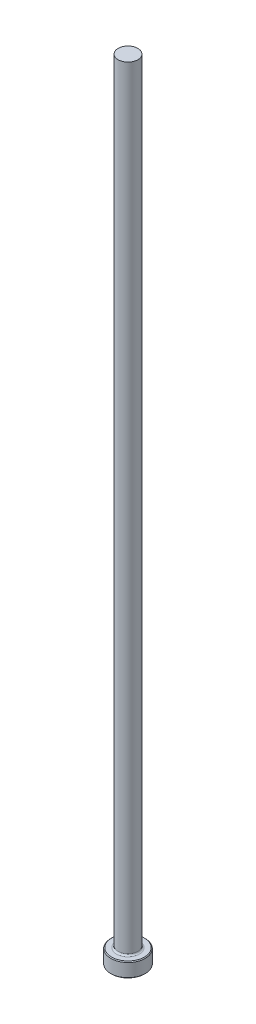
ISO-10303-21;
HEADER;
FILE_DESCRIPTION(('STEP AP214'),'2;1');
FILE_NAME('part.step','',(''),(''),'','','');
FILE_SCHEMA(('AUTOMOTIVE_DESIGN { 1 0 10303 214 1 1 1 1 }'));
ENDSEC;
DATA;
#1=APPLICATION_CONTEXT('core data for automotive mechanical design processes');
#2=APPLICATION_PROTOCOL_DEFINITION('international standard','automotive_design',2000,#1);
#3=PRODUCT_CONTEXT('',#1,'mechanical');
#4=PRODUCT('Part','Part','',(#3));
#5=PRODUCT_RELATED_PRODUCT_CATEGORY('part','',(#4));
#6=PRODUCT_DEFINITION_FORMATION('','',#4);
#7=PRODUCT_DEFINITION_CONTEXT('part definition',#1,'design');
#8=PRODUCT_DEFINITION('design','',#6,#7);
#9=PRODUCT_DEFINITION_SHAPE('','',#8);
#10=(LENGTH_UNIT() NAMED_UNIT(*) SI_UNIT(.MILLI.,.METRE.));
#11=(NAMED_UNIT(*) PLANE_ANGLE_UNIT() SI_UNIT($,.RADIAN.));
#12=(NAMED_UNIT(*) SI_UNIT($,.STERADIAN.) SOLID_ANGLE_UNIT());
#13=UNCERTAINTY_MEASURE_WITH_UNIT(LENGTH_MEASURE(1.E-05),#10,'distance_accuracy_value','');
#14=(GEOMETRIC_REPRESENTATION_CONTEXT(3) GLOBAL_UNCERTAINTY_ASSIGNED_CONTEXT((#13)) GLOBAL_UNIT_ASSIGNED_CONTEXT((#10,
#11,#12)) REPRESENTATION_CONTEXT('',''));
#15=CARTESIAN_POINT('',(0.,0.,0.));
#16=DIRECTION('',(0.,0.,1.));
#17=DIRECTION('',(1.,0.,0.));
#18=AXIS2_PLACEMENT_3D('',#15,#16,#17);
#19=CARTESIAN_POINT('',(0.,0.,0.));
#20=DIRECTION('',(0.,-1.,0.));
#21=DIRECTION('',(0.,0.,-1.));
#22=AXIS2_PLACEMENT_3D('',#19,#20,#21);
#23=PLANE('',#22);
#24=CARTESIAN_POINT('',(0.,0.,0.));
#25=DIRECTION('',(0.,-1.,0.));
#26=DIRECTION('',(0.,0.,-1.));
#27=AXIS2_PLACEMENT_3D('',#24,#25,#26);
#28=CIRCLE('',#27,5.29589999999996);
#29=CARTESIAN_POINT('',(0.,0.,-5.29589999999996));
#30=VERTEX_POINT('',#29);
#31=EDGE_CURVE('E46',#30,#30,#28,.T.);
#32=ORIENTED_EDGE('',*,*,#31,.T.);
#33=EDGE_LOOP('',(#32));
#34=FACE_BOUND('',#33,.T.);
#35=ADVANCED_FACE('F35',(#34),#23,.T.);
#36=CARTESIAN_POINT('',(0.,259.958771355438,0.));
#37=DIRECTION('',(0.,1.,0.));
#38=DIRECTION('',(0.,0.,1.));
#39=AXIS2_PLACEMENT_3D('',#36,#37,#38);
#40=CYLINDRICAL_SURFACE('',#39,5.54989999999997);
#41=CARTESIAN_POINT('',(0.,4.49580000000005,0.));
#42=DIRECTION('',(0.,1.,0.));
#43=DIRECTION('',(0.,0.,1.));
#44=AXIS2_PLACEMENT_3D('',#41,#42,#43);
#45=CIRCLE('',#44,5.54989999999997);
#46=CARTESIAN_POINT('',(0.,4.49580000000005,5.54989999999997));
#47=VERTEX_POINT('',#46);
#48=EDGE_CURVE('E50',#47,#47,#45,.F.);
#49=ORIENTED_EDGE('',*,*,#48,.T.);
#50=EDGE_LOOP('',(#49));
#51=FACE_BOUND('',#50,.T.);
#52=CARTESIAN_POINT('',(0.,0.253999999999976,0.));
#53=DIRECTION('',(0.,-1.,0.));
#54=DIRECTION('',(0.,0.,-1.));
#55=AXIS2_PLACEMENT_3D('',#52,#53,#54);
#56=CIRCLE('',#55,5.54989999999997);
#57=CARTESIAN_POINT('',(0.,0.253999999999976,-5.54989999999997));
#58=VERTEX_POINT('',#57);
#59=EDGE_CURVE('E55',#58,#58,#56,.F.);
#60=ORIENTED_EDGE('',*,*,#59,.T.);
#61=EDGE_LOOP('',(#60));
#62=FACE_BOUND('',#61,.T.);
#63=ADVANCED_FACE('F77',(#51,#62),#40,.T.);
#64=CARTESIAN_POINT('',(-5.54989999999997,4.7498,0.));
#65=DIRECTION('',(0.,1.,0.));
#66=DIRECTION('',(0.,0.,1.));
#67=AXIS2_PLACEMENT_3D('',#64,#65,#66);
#68=PLANE('',#67);
#69=CARTESIAN_POINT('',(0.,4.7498,0.));
#70=DIRECTION('',(0.,1.,0.));
#71=DIRECTION('',(0.,0.,1.));
#72=AXIS2_PLACEMENT_3D('',#69,#70,#71);
#73=CIRCLE('',#72,3.68299999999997);
#74=CARTESIAN_POINT('',(0.,4.7498,3.68299999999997));
#75=VERTEX_POINT('',#74);
#76=EDGE_CURVE('E10',#75,#75,#73,.F.);
#77=ORIENTED_EDGE('',*,*,#76,.T.);
#78=EDGE_LOOP('',(#77));
#79=FACE_BOUND('',#78,.T.);
#80=CARTESIAN_POINT('',(0.,4.7498,0.));
#81=DIRECTION('',(0.,1.,0.));
#82=DIRECTION('',(0.,0.,1.));
#83=AXIS2_PLACEMENT_3D('',#80,#81,#82);
#84=CIRCLE('',#83,5.29590000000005);
#85=CARTESIAN_POINT('',(0.,4.7498,5.29590000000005));
#86=VERTEX_POINT('',#85);
#87=EDGE_CURVE('E58',#86,#86,#84,.T.);
#88=ORIENTED_EDGE('',*,*,#87,.T.);
#89=EDGE_LOOP('',(#88));
#90=FACE_BOUND('',#89,.T.);
#91=ADVANCED_FACE('F69',(#79,#90),#68,.T.);
#92=CARTESIAN_POINT('',(0.,259.958771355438,0.));
#93=DIRECTION('',(0.,1.,0.));
#94=DIRECTION('',(0.,0.,1.));
#95=AXIS2_PLACEMENT_3D('',#92,#93,#94);
#96=CYLINDRICAL_SURFACE('',#95,3.17499999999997);
#97=CARTESIAN_POINT('',(0.,5.25779999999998,0.));
#98=DIRECTION('',(0.,1.,0.));
#99=DIRECTION('',(0.,0.,1.));
#100=AXIS2_PLACEMENT_3D('',#97,#98,#99);
#101=CIRCLE('',#100,3.17499999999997);
#102=CARTESIAN_POINT('',(0.,5.25779999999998,3.17499999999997));
#103=VERTEX_POINT('',#102);
#104=EDGE_CURVE('E42',#103,#103,#101,.T.);
#105=ORIENTED_EDGE('',*,*,#104,.T.);
#106=EDGE_LOOP('',(#105));
#107=FACE_BOUND('',#106,.T.);
#108=CARTESIAN_POINT('',(0.,254.,0.));
#109=DIRECTION('',(0.,1.,0.));
#110=DIRECTION('',(0.,0.,1.));
#111=AXIS2_PLACEMENT_3D('',#108,#109,#110);
#112=CIRCLE('',#111,3.17499999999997);
#113=CARTESIAN_POINT('',(0.,254.,3.17499999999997));
#114=VERTEX_POINT('',#113);
#115=EDGE_CURVE('E61',#114,#114,#112,.T.);
#116=ORIENTED_EDGE('',*,*,#115,.F.);
#117=EDGE_LOOP('',(#116));
#118=FACE_BOUND('',#117,.T.);
#119=ADVANCED_FACE('F67',(#107,#118),#96,.T.);
#120=CARTESIAN_POINT('',(-3.17499999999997,254.,0.));
#121=DIRECTION('',(0.,1.,0.));
#122=DIRECTION('',(0.,0.,1.));
#123=AXIS2_PLACEMENT_3D('',#120,#121,#122);
#124=PLANE('',#123);
#125=ORIENTED_EDGE('',*,*,#115,.T.);
#126=EDGE_LOOP('',(#125));
#127=FACE_BOUND('',#126,.T.);
#128=ADVANCED_FACE('F65',(#127),#124,.T.);
#129=CARTESIAN_POINT('',(0.,4.74980000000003,0.));
#130=DIRECTION('',(0.,-1.,0.));
#131=DIRECTION('',(0.,0.,-1.));
#132=AXIS2_PLACEMENT_3D('',#129,#130,#131);
#133=CONICAL_SURFACE('',#132,5.29590000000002,0.785398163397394);
#134=ORIENTED_EDGE('',*,*,#48,.F.);
#135=EDGE_LOOP('',(#134));
#136=FACE_BOUND('',#135,.T.);
#137=ORIENTED_EDGE('',*,*,#87,.F.);
#138=EDGE_LOOP('',(#137));
#139=FACE_BOUND('',#138,.T.);
#140=ADVANCED_FACE('F75',(#136,#139),#133,.T.);
#141=CARTESIAN_POINT('',(0.,0.253999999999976,0.));
#142=DIRECTION('',(0.,1.,0.));
#143=DIRECTION('',(0.,0.,1.));
#144=AXIS2_PLACEMENT_3D('',#141,#142,#143);
#145=CONICAL_SURFACE('',#144,5.54989999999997,0.785398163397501);
#146=ORIENTED_EDGE('',*,*,#31,.F.);
#147=EDGE_LOOP('',(#146));
#148=FACE_BOUND('',#147,.T.);
#149=ORIENTED_EDGE('',*,*,#59,.F.);
#150=EDGE_LOOP('',(#149));
#151=FACE_BOUND('',#150,.T.);
#152=ADVANCED_FACE('F89',(#148,#151),#145,.T.);
#153=CARTESIAN_POINT('',(0.,5.25779999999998,0.));
#154=DIRECTION('',(0.,1.,0.));
#155=DIRECTION('',(0.,0.,1.));
#156=AXIS2_PLACEMENT_3D('',#153,#154,#155);
#157=TOROIDAL_SURFACE('',#156,3.68299999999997,0.508);
#158=ORIENTED_EDGE('',*,*,#76,.F.);
#159=EDGE_LOOP('',(#158));
#160=FACE_BOUND('',#159,.T.);
#161=ORIENTED_EDGE('',*,*,#104,.F.);
#162=EDGE_LOOP('',(#161));
#163=FACE_BOUND('',#162,.T.);
#164=ADVANCED_FACE('F37',(#160,#163),#157,.F.);
#165=CLOSED_SHELL('',(#35,#63,#91,#119,#128,#140,#152,#164));
#166=MANIFOLD_SOLID_BREP('B2',#165);
#167=ADVANCED_BREP_SHAPE_REPRESENTATION('',(#18,#166),#14);
#168=SHAPE_DEFINITION_REPRESENTATION(#9,#167);
ENDSEC;
END-ISO-10303-21;
